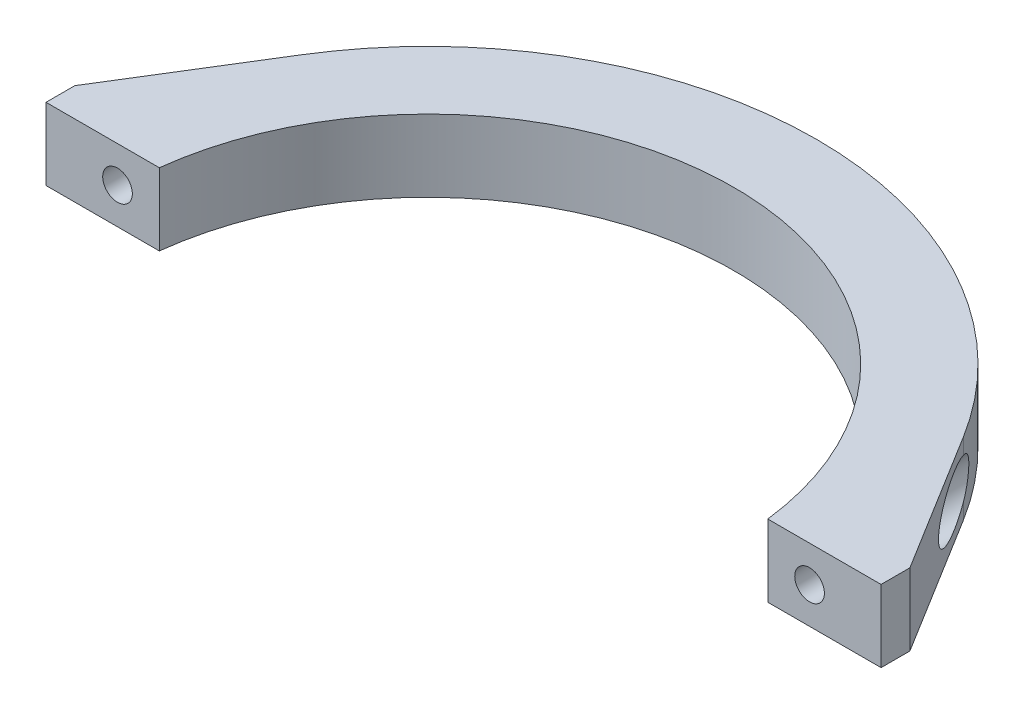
from build123d import *

# Parameters (mm, degrees)
EXTRUDE1_DEPTH          = 15.875
CUT_EXTRUDE1_START      = -9.525
SKETCH2_R               = 5.55625
CUT_EXTRUDE1_DEPTH      = 120.699961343
F_1_4_CLEARANCE_HOLE1_D = 6.5278


with BuildPart() as part:
    # Sketch1 → Extrude1 (new body)
    with BuildSketch(Plane(origin=(0, 46.8376, 0), x_dir=(-1, 0, 0), z_dir=(0, 1, 0))):
        with BuildLine():
            Line((91.948, -158.75), (66.993816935, -158.75))
            ThreePointArc((66.993816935, -158.75), (0, -218.2749), (-66.993816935, -158.75))
            Line((-66.993816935, -158.75), (-91.948, -158.75))
            Line((-91.948, -158.75), (-91.948, -165.1))
            Line((-91.948, -165.1), (-72.919520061, -195.884877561))
            ThreePointArc((-72.919520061, -195.884877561), (0, -236.5375), (72.919520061, -195.884877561))
            Line((72.919520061, -195.884877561), (91.948, -165.1))
            Line((91.948, -165.1), (91.948, -158.75))
        make_face()
    extrude(amount=-EXTRUDE1_DEPTH)

    # Sketch2 → Cut-Extrude1 (cut, through all)
    with BuildSketch(Plane.XY.offset(-158.75).offset(CUT_EXTRUDE1_START)):
        with Locations((-76.2, 38.9001)):
            Circle(SKETCH2_R)
        with Locations((76.2, 38.9001)):
            Circle(SKETCH2_R)
    extrude(amount=-CUT_EXTRUDE1_DEPTH, mode=Mode.SUBTRACT)

    # 1_4 Clearance Hole1 (through all)
    with Locations(Plane(origin=(0, 0, -168.275), x_dir=(-1, 0, 0), z_dir=(0, 0, -1))):
        with Locations((-76.2, 38.9001), (76.2, 38.9001)):
            Hole(F_1_4_CLEARANCE_HOLE1_D / 2)


solid = part.part
